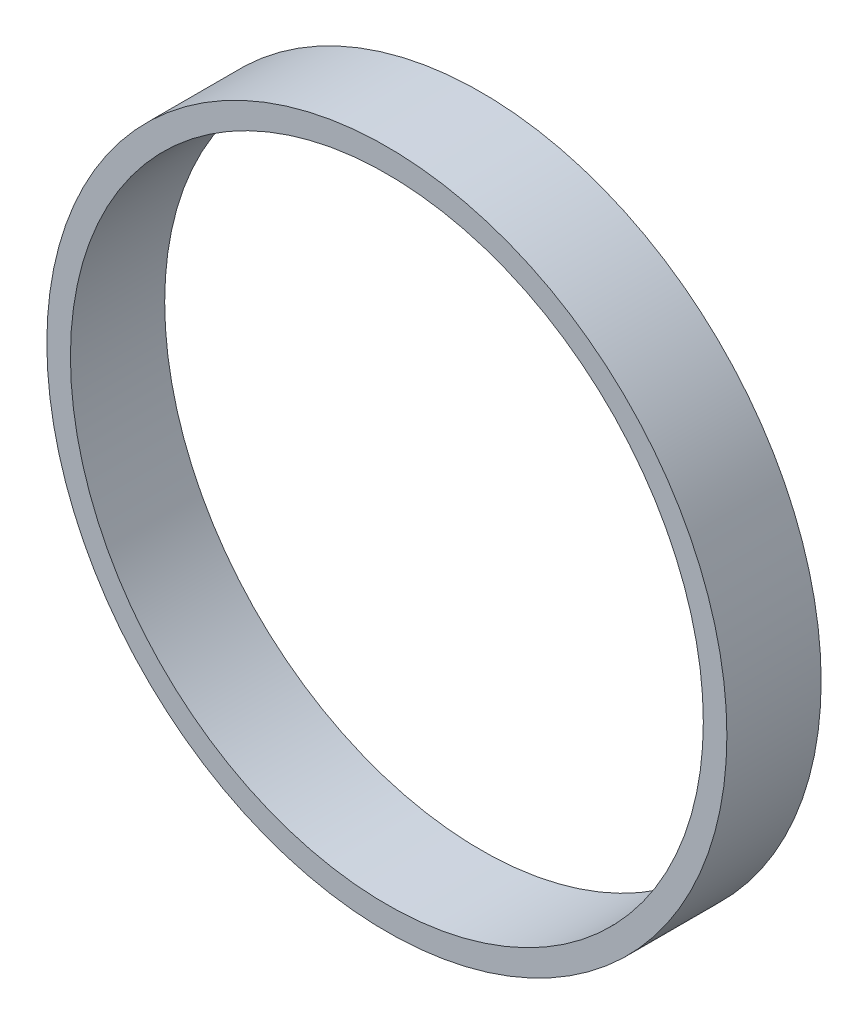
ISO-10303-21;
HEADER;
FILE_DESCRIPTION(('STEP AP214'),'2;1');
FILE_NAME('part.step','',(''),(''),'','','');
FILE_SCHEMA(('AUTOMOTIVE_DESIGN { 1 0 10303 214 1 1 1 1 }'));
ENDSEC;
DATA;
#1=APPLICATION_CONTEXT('core data for automotive mechanical design processes');
#2=APPLICATION_PROTOCOL_DEFINITION('international standard','automotive_design',2000,#1);
#3=PRODUCT_CONTEXT('',#1,'mechanical');
#4=PRODUCT('Part','Part','',(#3));
#5=PRODUCT_RELATED_PRODUCT_CATEGORY('part','',(#4));
#6=PRODUCT_DEFINITION_FORMATION('','',#4);
#7=PRODUCT_DEFINITION_CONTEXT('part definition',#1,'design');
#8=PRODUCT_DEFINITION('design','',#6,#7);
#9=PRODUCT_DEFINITION_SHAPE('','',#8);
#10=(LENGTH_UNIT() NAMED_UNIT(*) SI_UNIT(.MILLI.,.METRE.));
#11=(NAMED_UNIT(*) PLANE_ANGLE_UNIT() SI_UNIT($,.RADIAN.));
#12=(NAMED_UNIT(*) SI_UNIT($,.STERADIAN.) SOLID_ANGLE_UNIT());
#13=UNCERTAINTY_MEASURE_WITH_UNIT(LENGTH_MEASURE(1.E-05),#10,'distance_accuracy_value','');
#14=(GEOMETRIC_REPRESENTATION_CONTEXT(3) GLOBAL_UNCERTAINTY_ASSIGNED_CONTEXT((#13)) GLOBAL_UNIT_ASSIGNED_CONTEXT((#10,
#11,#12)) REPRESENTATION_CONTEXT('',''));
#15=CARTESIAN_POINT('',(0.,0.,0.));
#16=DIRECTION('',(0.,0.,1.));
#17=DIRECTION('',(1.,0.,0.));
#18=AXIS2_PLACEMENT_3D('',#15,#16,#17);
#19=CARTESIAN_POINT('',(0.,0.,3.5));
#20=DIRECTION('',(0.,0.,1.));
#21=DIRECTION('',(1.,0.,0.));
#22=AXIS2_PLACEMENT_3D('',#19,#20,#21);
#23=PLANE('',#22);
#24=CARTESIAN_POINT('',(0.,0.,3.5));
#25=DIRECTION('',(0.,0.,1.));
#26=DIRECTION('',(1.,0.,0.));
#27=AXIS2_PLACEMENT_3D('',#24,#25,#26);
#28=CIRCLE('',#27,25.25);
#29=CARTESIAN_POINT('',(25.25,0.,3.5));
#30=VERTEX_POINT('',#29);
#31=EDGE_CURVE('E10',#30,#30,#28,.T.);
#32=ORIENTED_EDGE('',*,*,#31,.T.);
#33=EDGE_LOOP('',(#32));
#34=FACE_BOUND('',#33,.T.);
#35=CARTESIAN_POINT('',(0.,0.,3.5));
#36=DIRECTION('',(0.,0.,1.));
#37=DIRECTION('',(1.,0.,0.));
#38=AXIS2_PLACEMENT_3D('',#35,#36,#37);
#39=CIRCLE('',#38,23.5);
#40=CARTESIAN_POINT('',(23.5,0.,3.5));
#41=VERTEX_POINT('',#40);
#42=EDGE_CURVE('E54',#41,#41,#39,.T.);
#43=ORIENTED_EDGE('',*,*,#42,.F.);
#44=EDGE_LOOP('',(#43));
#45=FACE_BOUND('',#44,.T.);
#46=ADVANCED_FACE('F41',(#34,#45),#23,.T.);
#47=CARTESIAN_POINT('',(0.,0.,-3.5));
#48=DIRECTION('',(0.,0.,1.));
#49=DIRECTION('',(1.,0.,0.));
#50=AXIS2_PLACEMENT_3D('',#47,#48,#49);
#51=PLANE('',#50);
#52=CARTESIAN_POINT('',(0.,0.,-3.5));
#53=DIRECTION('',(0.,0.,1.));
#54=DIRECTION('',(1.,0.,0.));
#55=AXIS2_PLACEMENT_3D('',#52,#53,#54);
#56=CIRCLE('',#55,25.25);
#57=CARTESIAN_POINT('',(25.25,0.,-3.5));
#58=VERTEX_POINT('',#57);
#59=EDGE_CURVE('E45',#58,#58,#56,.T.);
#60=ORIENTED_EDGE('',*,*,#59,.F.);
#61=EDGE_LOOP('',(#60));
#62=FACE_BOUND('',#61,.T.);
#63=CARTESIAN_POINT('',(0.,0.,-3.5));
#64=DIRECTION('',(0.,0.,1.));
#65=DIRECTION('',(1.,0.,0.));
#66=AXIS2_PLACEMENT_3D('',#63,#64,#65);
#67=CIRCLE('',#66,23.5);
#68=CARTESIAN_POINT('',(23.5,0.,-3.5));
#69=VERTEX_POINT('',#68);
#70=EDGE_CURVE('E56',#69,#69,#67,.T.);
#71=ORIENTED_EDGE('',*,*,#70,.T.);
#72=EDGE_LOOP('',(#71));
#73=FACE_BOUND('',#72,.T.);
#74=ADVANCED_FACE('F68',(#62,#73),#51,.F.);
#75=CARTESIAN_POINT('',(0.,0.,3.5));
#76=DIRECTION('',(0.,0.,-1.));
#77=DIRECTION('',(-1.,0.,0.));
#78=AXIS2_PLACEMENT_3D('',#75,#76,#77);
#79=CYLINDRICAL_SURFACE('',#78,25.25);
#80=ORIENTED_EDGE('',*,*,#31,.F.);
#81=EDGE_LOOP('',(#80));
#82=FACE_BOUND('',#81,.T.);
#83=ORIENTED_EDGE('',*,*,#59,.T.);
#84=EDGE_LOOP('',(#83));
#85=FACE_BOUND('',#84,.T.);
#86=ADVANCED_FACE('F43',(#82,#85),#79,.T.);
#87=CARTESIAN_POINT('',(0.,0.,3.5));
#88=DIRECTION('',(0.,0.,-1.));
#89=DIRECTION('',(-1.,0.,0.));
#90=AXIS2_PLACEMENT_3D('',#87,#88,#89);
#91=CYLINDRICAL_SURFACE('',#90,23.5);
#92=ORIENTED_EDGE('',*,*,#42,.T.);
#93=EDGE_LOOP('',(#92));
#94=FACE_BOUND('',#93,.T.);
#95=ORIENTED_EDGE('',*,*,#70,.F.);
#96=EDGE_LOOP('',(#95));
#97=FACE_BOUND('',#96,.T.);
#98=ADVANCED_FACE('F64',(#94,#97),#91,.F.);
#99=CLOSED_SHELL('',(#46,#74,#86,#98));
#100=MANIFOLD_SOLID_BREP('B2',#99);
#101=ADVANCED_BREP_SHAPE_REPRESENTATION('',(#18,#100),#14);
#102=SHAPE_DEFINITION_REPRESENTATION(#9,#101);
ENDSEC;
END-ISO-10303-21;
